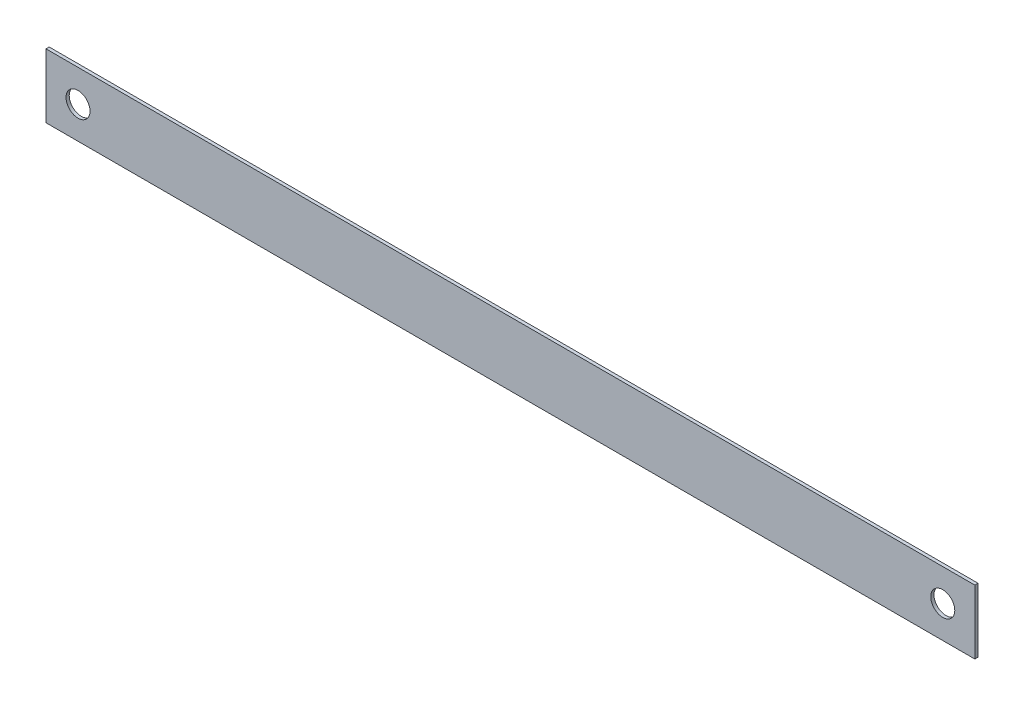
from build123d import *

# Parameters (mm, degrees)
SKETCH1_W          = 290
SKETCH1_H          = 20
BASE_EXTRUDE_DEPTH = 1
SKETCH2_R          = 3.75
CUT_EXTRUDE1_DEPTH = 146.347858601


with BuildPart() as part:
    # Sketch1 → Base-Extrude (new body)
    with BuildSketch(Plane.XY):
        Rectangle(SKETCH1_W, SKETCH1_H)
    extrude(amount=BASE_EXTRUDE_DEPTH)

    # Sketch2 → Cut-Extrude1 (cut, through all)
    with BuildSketch(Plane.XY.offset(1)):
        with Locations((135, 0)):
            Circle(SKETCH2_R)
    cut_extrude1 = extrude(amount=-CUT_EXTRUDE1_DEPTH, mode=Mode.SUBTRACT)

    # Mirror1: Cut-Extrude1 across plane
    add(cut_extrude1.mirror(Plane(origin=(0, 0, 0), x_dir=(0, 0, 1), z_dir=(1, 0, 0))), mode=Mode.SUBTRACT)


solid = part.part
